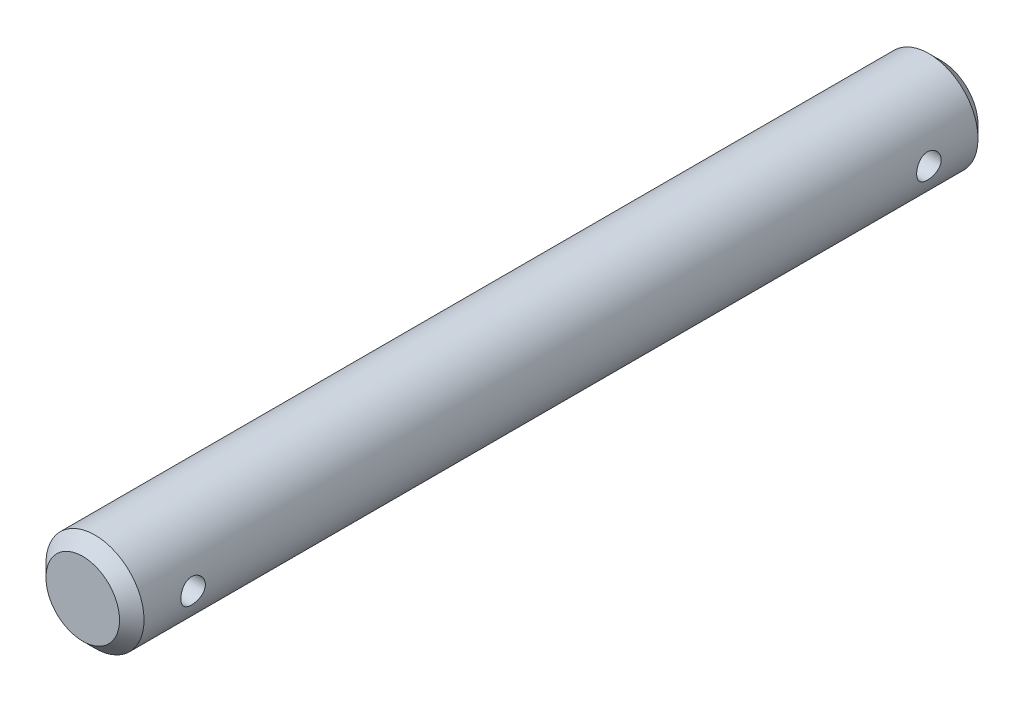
ISO-10303-21;
HEADER;
FILE_DESCRIPTION(('STEP AP214'),'2;1');
FILE_NAME('part.step','',(''),(''),'','','');
FILE_SCHEMA(('AUTOMOTIVE_DESIGN { 1 0 10303 214 1 1 1 1 }'));
ENDSEC;
DATA;
#1=APPLICATION_CONTEXT('core data for automotive mechanical design processes');
#2=APPLICATION_PROTOCOL_DEFINITION('international standard','automotive_design',2000,#1);
#3=PRODUCT_CONTEXT('',#1,'mechanical');
#4=PRODUCT('Part','Part','',(#3));
#5=PRODUCT_RELATED_PRODUCT_CATEGORY('part','',(#4));
#6=PRODUCT_DEFINITION_FORMATION('','',#4);
#7=PRODUCT_DEFINITION_CONTEXT('part definition',#1,'design');
#8=PRODUCT_DEFINITION('design','',#6,#7);
#9=PRODUCT_DEFINITION_SHAPE('','',#8);
#10=(LENGTH_UNIT() NAMED_UNIT(*) SI_UNIT(.MILLI.,.METRE.));
#11=(NAMED_UNIT(*) PLANE_ANGLE_UNIT() SI_UNIT($,.RADIAN.));
#12=(NAMED_UNIT(*) SI_UNIT($,.STERADIAN.) SOLID_ANGLE_UNIT());
#13=UNCERTAINTY_MEASURE_WITH_UNIT(LENGTH_MEASURE(1.E-05),#10,'distance_accuracy_value','');
#14=(GEOMETRIC_REPRESENTATION_CONTEXT(3) GLOBAL_UNCERTAINTY_ASSIGNED_CONTEXT((#13)) GLOBAL_UNIT_ASSIGNED_CONTEXT((#10,
#11,#12)) REPRESENTATION_CONTEXT('',''));
#15=CARTESIAN_POINT('',(0.,0.,0.));
#16=DIRECTION('',(0.,0.,1.));
#17=DIRECTION('',(1.,0.,0.));
#18=AXIS2_PLACEMENT_3D('',#15,#16,#17);
#19=CARTESIAN_POINT('',(0.,0.,70.));
#20=DIRECTION('',(0.,0.,-1.));
#21=DIRECTION('',(-1.,0.,0.));
#22=AXIS2_PLACEMENT_3D('',#19,#20,#21);
#23=CYLINDRICAL_SURFACE('',#22,4.);
#24=CARTESIAN_POINT('',(-4.,0.,6.));
#25=CARTESIAN_POINT('',(-3.99999906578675,-0.0552507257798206,5.9999984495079));
#26=CARTESIAN_POINT('',(-3.99884385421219,-0.110518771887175,5.99540563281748));
#27=CARTESIAN_POINT('',(-3.99434742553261,-0.219470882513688,5.977183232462));
#28=CARTESIAN_POINT('',(-3.99100496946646,-0.273154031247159,5.96354852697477));
#29=CARTESIAN_POINT('',(-3.98250417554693,-0.377347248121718,5.92770716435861));
#30=CARTESIAN_POINT('',(-3.97734801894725,-0.427861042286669,5.90551080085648));
#31=CARTESIAN_POINT('',(-3.96576895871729,-0.524448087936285,5.85321240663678));
#32=CARTESIAN_POINT('',(-3.95934601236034,-0.57052118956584,5.82311010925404));
#33=CARTESIAN_POINT('',(-3.94578275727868,-0.657867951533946,5.75519947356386));
#34=CARTESIAN_POINT('',(-3.93863138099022,-0.699037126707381,5.71725895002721));
#35=CARTESIAN_POINT('',(-3.92449080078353,-0.774499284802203,5.63503186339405));
#36=CARTESIAN_POINT('',(-3.91750161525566,-0.808791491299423,5.59074458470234));
#37=CARTESIAN_POINT('',(-3.9043651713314,-0.870017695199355,5.49626984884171));
#38=CARTESIAN_POINT('',(-3.89823196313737,-0.896834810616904,5.44600451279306));
#39=CARTESIAN_POINT('',(-3.88766329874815,-0.941597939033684,5.34150105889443));
#40=CARTESIAN_POINT('',(-3.88322757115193,-0.959545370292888,5.28726357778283));
#41=CARTESIAN_POINT('',(-3.87666984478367,-0.985703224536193,5.17750433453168));
#42=CARTESIAN_POINT('',(-3.87450327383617,-0.994101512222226,5.12203006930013));
#43=CARTESIAN_POINT('',(-3.87259575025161,-1.00150785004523,5.01042095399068));
#44=CARTESIAN_POINT('',(-3.87285440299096,-1.00051742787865,4.95428621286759));
#45=CARTESIAN_POINT('',(-3.87572803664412,-0.98932434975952,4.84438946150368));
#46=CARTESIAN_POINT('',(-3.87828575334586,-0.979345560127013,4.79060291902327));
#47=CARTESIAN_POINT('',(-3.88537806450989,-0.950816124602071,4.6854926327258));
#48=CARTESIAN_POINT('',(-3.88991279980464,-0.932264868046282,4.63416906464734));
#49=CARTESIAN_POINT('',(-3.90050075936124,-0.886926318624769,4.53484132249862));
#50=CARTESIAN_POINT('',(-3.90656884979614,-0.860057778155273,4.48687588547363));
#51=CARTESIAN_POINT('',(-3.91953140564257,-0.798904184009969,4.39605419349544));
#52=CARTESIAN_POINT('',(-3.9264260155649,-0.764617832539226,4.35319883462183));
#53=CARTESIAN_POINT('',(-3.94050587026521,-0.688442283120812,4.2725309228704));
#54=CARTESIAN_POINT('',(-3.94769379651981,-0.646364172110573,4.23489700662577));
#55=CARTESIAN_POINT('',(-3.96137310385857,-0.556407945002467,4.1671858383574));
#56=CARTESIAN_POINT('',(-3.96786446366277,-0.508529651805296,4.13710881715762));
#57=CARTESIAN_POINT('',(-3.97945154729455,-0.408077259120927,4.08529960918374));
#58=CARTESIAN_POINT('',(-3.9845424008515,-0.355487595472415,4.06359643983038));
#59=CARTESIAN_POINT('',(-3.99271944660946,-0.247250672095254,4.02938846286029));
#60=CARTESIAN_POINT('',(-3.99580602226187,-0.191603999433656,4.01688189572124));
#61=CARTESIAN_POINT('',(-3.9995699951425,-0.0803599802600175,4.00169495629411));
#62=CARTESIAN_POINT('',(-4.00030702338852,-0.0247978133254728,3.9987713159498));
#63=CARTESIAN_POINT('',(-3.999458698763,0.086021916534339,4.00216600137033));
#64=CARTESIAN_POINT('',(-3.99787355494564,0.14127950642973,4.00848349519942));
#65=CARTESIAN_POINT('',(-3.99259720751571,0.249076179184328,4.02998060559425));
#66=CARTESIAN_POINT('',(-3.98893756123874,0.301643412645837,4.04502750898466));
#67=CARTESIAN_POINT('',(-3.97992471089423,0.403504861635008,4.08340472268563));
#68=CARTESIAN_POINT('',(-3.97457133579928,0.452798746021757,4.10673586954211));
#69=CARTESIAN_POINT('',(-3.96262205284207,0.547682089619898,4.16149075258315));
#70=CARTESIAN_POINT('',(-3.95600578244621,0.59319029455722,4.19305074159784));
#71=CARTESIAN_POINT('',(-3.94229672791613,0.678351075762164,4.26319327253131));
#72=CARTESIAN_POINT('',(-3.93520386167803,0.718002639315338,4.30177702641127));
#73=CARTESIAN_POINT('',(-3.92112637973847,0.79132704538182,4.38600130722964));
#74=CARTESIAN_POINT('',(-3.91414869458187,0.824829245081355,4.43179180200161));
#75=CARTESIAN_POINT('',(-3.90128585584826,0.883673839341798,4.52848842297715));
#76=CARTESIAN_POINT('',(-3.89540065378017,0.909016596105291,4.57939432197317));
#77=CARTESIAN_POINT('',(-3.88545396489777,0.950634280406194,4.68460381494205));
#78=CARTESIAN_POINT('',(-3.88138170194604,0.96696293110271,4.73888508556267));
#79=CARTESIAN_POINT('',(-3.87551162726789,0.990230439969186,4.84953975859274));
#80=CARTESIAN_POINT('',(-3.87371331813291,0.997171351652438,4.90591270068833));
#81=CARTESIAN_POINT('',(-3.87263267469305,1.00135906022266,5.01741401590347));
#82=CARTESIAN_POINT('',(-3.87327955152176,0.998878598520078,5.07253162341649));
#83=CARTESIAN_POINT('',(-3.87685272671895,0.984918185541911,5.18153592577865));
#84=CARTESIAN_POINT('',(-3.87977897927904,0.973438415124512,5.23542264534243));
#85=CARTESIAN_POINT('',(-3.88754173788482,0.941954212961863,5.34013897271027));
#86=CARTESIAN_POINT('',(-3.89236676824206,0.922000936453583,5.39098487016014));
#87=CARTESIAN_POINT('',(-3.90338503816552,0.874176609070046,5.48864358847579));
#88=CARTESIAN_POINT('',(-3.90957846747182,0.846304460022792,5.53545584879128));
#89=CARTESIAN_POINT('',(-3.92283756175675,0.782578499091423,5.62503641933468));
#90=CARTESIAN_POINT('',(-3.92992176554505,0.746535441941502,5.66766738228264));
#91=CARTESIAN_POINT('',(-3.94405351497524,0.667859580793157,5.74636469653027));
#92=CARTESIAN_POINT('',(-3.95110105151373,0.625225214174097,5.78242948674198));
#93=CARTESIAN_POINT('',(-3.96451770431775,0.533645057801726,5.84760753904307));
#94=CARTESIAN_POINT('',(-3.97087222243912,0.484598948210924,5.87658307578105));
#95=CARTESIAN_POINT('',(-3.98203283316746,0.382177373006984,5.92583164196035));
#96=CARTESIAN_POINT('',(-3.98684003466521,0.328805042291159,5.94611090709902));
#97=CARTESIAN_POINT('',(-3.99365373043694,0.229606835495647,5.97438122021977));
#98=CARTESIAN_POINT('',(-3.9960172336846,0.184253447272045,5.98396749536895));
#99=CARTESIAN_POINT('',(-3.99919070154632,0.0926040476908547,5.99677729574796));
#100=CARTESIAN_POINT('',(-4.00000078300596,0.0463081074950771,6.00000129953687));
#101=CARTESIAN_POINT('',(-4.,0.,6.));
#102=B_SPLINE_CURVE_WITH_KNOTS('',3,(#24,#25,#26,#27,#28,#29,#30,#31,#32,#33,#34,#35,#36,#37,
#38,#39,#40,#41,#42,#43,#44,#45,#46,#47,#48,#49,#50,#51,#52,#53,#54,#55,#56,#57,#58,#59,#60,#61,
#62,#63,#64,#65,#66,#67,#68,#69,#70,#71,#72,#73,#74,#75,#76,#77,#78,#79,#80,#81,#82,#83,#84,#85,
#86,#87,#88,#89,#90,#91,#92,#93,#94,#95,#96,#97,#98,#99,#100,#101),.UNSPECIFIED.,.T.,.F.,(4,2,2,
2,2,2,2,2,2,2,2,2,2,2,2,2,2,2,2,2,2,2,2,2,2,2,2,2,2,2,2,2,2,2,2,2,2,2,4),(0.,0.16558247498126,
0.331258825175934,0.496736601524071,0.662219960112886,0.830762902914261,0.99932486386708,
1.17039098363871,1.34142974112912,1.50904196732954,1.67662692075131,1.84014998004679,
2.00368468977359,2.16887018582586,2.33408460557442,2.50401000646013,2.67394059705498,
2.84445486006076,3.01493649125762,3.18105539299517,3.34715934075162,3.51080183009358,
3.67446084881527,3.84102391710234,4.00761575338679,4.17829672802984,4.34897012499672,
4.51861503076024,4.68822282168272,4.85295853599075,5.01769093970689,5.18144267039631,
5.34521712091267,5.51326384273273,5.68135046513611,5.85248123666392,6.02348909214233,
6.16228161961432,6.30106370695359),.UNSPECIFIED.);
#103=CARTESIAN_POINT('',(-4.,0.,6.));
#104=VERTEX_POINT('',#103);
#105=EDGE_CURVE('E10',#104,#104,#102,.T.);
#106=ORIENTED_EDGE('',*,*,#105,.T.);
#107=EDGE_LOOP('',(#106));
#108=FACE_BOUND('',#107,.T.);
#109=CARTESIAN_POINT('',(4.,0.,4.));
#110=CARTESIAN_POINT('',(3.99999906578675,-0.0552507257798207,4.00000155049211));
#111=CARTESIAN_POINT('',(3.99884385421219,-0.110518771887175,4.00459436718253));
#112=CARTESIAN_POINT('',(3.99434742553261,-0.219470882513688,4.022816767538));
#113=CARTESIAN_POINT('',(3.99100496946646,-0.273154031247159,4.03645147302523));
#114=CARTESIAN_POINT('',(3.98250417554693,-0.377347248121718,4.07229283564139));
#115=CARTESIAN_POINT('',(3.97734801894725,-0.427861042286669,4.09448919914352));
#116=CARTESIAN_POINT('',(3.96576895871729,-0.524448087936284,4.14678759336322));
#117=CARTESIAN_POINT('',(3.95934601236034,-0.570521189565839,4.17688989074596));
#118=CARTESIAN_POINT('',(3.94578275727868,-0.657867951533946,4.24480052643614));
#119=CARTESIAN_POINT('',(3.93863138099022,-0.699037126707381,4.28274104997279));
#120=CARTESIAN_POINT('',(3.92449080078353,-0.774499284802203,4.36496813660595));
#121=CARTESIAN_POINT('',(3.91750161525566,-0.808791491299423,4.40925541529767));
#122=CARTESIAN_POINT('',(3.9043651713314,-0.870017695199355,4.50373015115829));
#123=CARTESIAN_POINT('',(3.89823196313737,-0.896834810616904,4.55399548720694));
#124=CARTESIAN_POINT('',(3.88766329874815,-0.941597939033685,4.65849894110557));
#125=CARTESIAN_POINT('',(3.88322757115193,-0.959545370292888,4.71273642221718));
#126=CARTESIAN_POINT('',(3.87666984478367,-0.985703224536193,4.82249566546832));
#127=CARTESIAN_POINT('',(3.87450327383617,-0.994101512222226,4.87796993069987));
#128=CARTESIAN_POINT('',(3.87259575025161,-1.00150785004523,4.98957904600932));
#129=CARTESIAN_POINT('',(3.87285440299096,-1.00051742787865,5.04571378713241));
#130=CARTESIAN_POINT('',(3.87572803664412,-0.98932434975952,5.15561053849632));
#131=CARTESIAN_POINT('',(3.87828575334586,-0.979345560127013,5.20939708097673));
#132=CARTESIAN_POINT('',(3.88537806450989,-0.950816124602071,5.3145073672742));
#133=CARTESIAN_POINT('',(3.88991279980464,-0.932264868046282,5.36583093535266));
#134=CARTESIAN_POINT('',(3.90050075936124,-0.886926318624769,5.46515867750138));
#135=CARTESIAN_POINT('',(3.90656884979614,-0.860057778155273,5.51312411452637));
#136=CARTESIAN_POINT('',(3.91953140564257,-0.798904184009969,5.60394580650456));
#137=CARTESIAN_POINT('',(3.9264260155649,-0.764617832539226,5.64680116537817));
#138=CARTESIAN_POINT('',(3.94050587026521,-0.688442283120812,5.7274690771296));
#139=CARTESIAN_POINT('',(3.94769379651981,-0.646364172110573,5.76510299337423));
#140=CARTESIAN_POINT('',(3.96137310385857,-0.556407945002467,5.8328141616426));
#141=CARTESIAN_POINT('',(3.96786446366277,-0.508529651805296,5.86289118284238));
#142=CARTESIAN_POINT('',(3.97945154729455,-0.408077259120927,5.91470039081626));
#143=CARTESIAN_POINT('',(3.9845424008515,-0.355487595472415,5.93640356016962));
#144=CARTESIAN_POINT('',(3.99271944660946,-0.247250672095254,5.97061153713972));
#145=CARTESIAN_POINT('',(3.99580602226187,-0.191603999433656,5.98311810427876));
#146=CARTESIAN_POINT('',(3.9995699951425,-0.0803599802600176,5.99830504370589));
#147=CARTESIAN_POINT('',(4.00030702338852,-0.0247978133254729,6.0012286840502));
#148=CARTESIAN_POINT('',(3.999458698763,0.0860219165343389,5.99783399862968));
#149=CARTESIAN_POINT('',(3.99787355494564,0.14127950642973,5.99151650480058));
#150=CARTESIAN_POINT('',(3.99259720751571,0.249076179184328,5.97001939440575));
#151=CARTESIAN_POINT('',(3.98893756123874,0.301643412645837,5.95497249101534));
#152=CARTESIAN_POINT('',(3.97992471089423,0.403504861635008,5.91659527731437));
#153=CARTESIAN_POINT('',(3.97457133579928,0.452798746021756,5.89326413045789));
#154=CARTESIAN_POINT('',(3.96262205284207,0.547682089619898,5.83850924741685));
#155=CARTESIAN_POINT('',(3.95600578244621,0.59319029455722,5.80694925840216));
#156=CARTESIAN_POINT('',(3.94229672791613,0.678351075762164,5.73680672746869));
#157=CARTESIAN_POINT('',(3.93520386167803,0.718002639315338,5.69822297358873));
#158=CARTESIAN_POINT('',(3.92112637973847,0.79132704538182,5.61399869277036));
#159=CARTESIAN_POINT('',(3.91414869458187,0.824829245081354,5.56820819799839));
#160=CARTESIAN_POINT('',(3.90128585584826,0.883673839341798,5.47151157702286));
#161=CARTESIAN_POINT('',(3.89540065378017,0.909016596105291,5.42060567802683));
#162=CARTESIAN_POINT('',(3.88545396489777,0.950634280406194,5.31539618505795));
#163=CARTESIAN_POINT('',(3.88138170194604,0.96696293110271,5.26111491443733));
#164=CARTESIAN_POINT('',(3.87551162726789,0.990230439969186,5.15046024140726));
#165=CARTESIAN_POINT('',(3.87371331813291,0.997171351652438,5.09408729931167));
#166=CARTESIAN_POINT('',(3.87263267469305,1.00135906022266,4.98258598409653));
#167=CARTESIAN_POINT('',(3.87327955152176,0.998878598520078,4.92746837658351));
#168=CARTESIAN_POINT('',(3.87685272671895,0.984918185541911,4.81846407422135));
#169=CARTESIAN_POINT('',(3.87977897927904,0.973438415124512,4.76457735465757));
#170=CARTESIAN_POINT('',(3.88754173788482,0.941954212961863,4.65986102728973));
#171=CARTESIAN_POINT('',(3.89236676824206,0.922000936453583,4.60901512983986));
#172=CARTESIAN_POINT('',(3.90338503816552,0.874176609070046,4.51135641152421));
#173=CARTESIAN_POINT('',(3.90957846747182,0.846304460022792,4.46454415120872));
#174=CARTESIAN_POINT('',(3.92283756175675,0.782578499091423,4.37496358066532));
#175=CARTESIAN_POINT('',(3.92992176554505,0.746535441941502,4.33233261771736));
#176=CARTESIAN_POINT('',(3.94405351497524,0.667859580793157,4.25363530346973));
#177=CARTESIAN_POINT('',(3.95110105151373,0.625225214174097,4.21757051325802));
#178=CARTESIAN_POINT('',(3.96451770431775,0.533645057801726,4.15239246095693));
#179=CARTESIAN_POINT('',(3.97087222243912,0.484598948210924,4.12341692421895));
#180=CARTESIAN_POINT('',(3.98203283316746,0.382177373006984,4.07416835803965));
#181=CARTESIAN_POINT('',(3.98684003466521,0.328805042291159,4.05388909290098));
#182=CARTESIAN_POINT('',(3.99365373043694,0.229606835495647,4.02561877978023));
#183=CARTESIAN_POINT('',(3.9960172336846,0.184253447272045,4.01603250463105));
#184=CARTESIAN_POINT('',(3.99919070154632,0.0926040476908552,4.00322270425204));
#185=CARTESIAN_POINT('',(4.00000078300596,0.0463081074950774,3.99999870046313));
#186=CARTESIAN_POINT('',(4.,0.,4.));
#187=B_SPLINE_CURVE_WITH_KNOTS('',3,(#109,#110,#111,#112,#113,#114,#115,#116,#117,#118,#119,
#120,#121,#122,#123,#124,#125,#126,#127,#128,#129,#130,#131,#132,#133,#134,#135,#136,#137,#138,
#139,#140,#141,#142,#143,#144,#145,#146,#147,#148,#149,#150,#151,#152,#153,#154,#155,#156,#157,
#158,#159,#160,#161,#162,#163,#164,#165,#166,#167,#168,#169,#170,#171,#172,#173,#174,#175,#176,
#177,#178,#179,#180,#181,#182,#183,#184,#185,#186),.UNSPECIFIED.,.T.,.F.,(4,2,2,2,2,2,2,2,2,2,2,
2,2,2,2,2,2,2,2,2,2,2,2,2,2,2,2,2,2,2,2,2,2,2,2,2,2,2,4),(0.,0.16558247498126,0.331258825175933,
0.49673660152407,0.662219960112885,0.83076290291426,0.999324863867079,1.17039098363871,
1.34142974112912,1.50904196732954,1.67662692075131,1.84014998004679,2.00368468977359,
2.16887018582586,2.33408460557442,2.50401000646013,2.67394059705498,2.84445486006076,
3.01493649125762,3.18105539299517,3.34715934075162,3.51080183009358,3.67446084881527,
3.84102391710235,4.00761575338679,4.17829672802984,4.34897012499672,4.51861503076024,
4.68822282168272,4.85295853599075,5.01769093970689,5.18144267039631,5.34521712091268,
5.51326384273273,5.68135046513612,5.85248123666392,6.02348909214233,6.16228161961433,
6.3010637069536),.UNSPECIFIED.);
#188=CARTESIAN_POINT('',(4.,0.,4.));
#189=VERTEX_POINT('',#188);
#190=EDGE_CURVE('E32',#189,#189,#187,.T.);
#191=ORIENTED_EDGE('',*,*,#190,.T.);
#192=EDGE_LOOP('',(#191));
#193=FACE_BOUND('',#192,.T.);
#194=CARTESIAN_POINT('',(-4.,0.,66.));
#195=CARTESIAN_POINT('',(-3.99999906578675,-0.0552507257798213,65.9999984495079));
#196=CARTESIAN_POINT('',(-3.99884385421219,-0.110518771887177,65.9954056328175));
#197=CARTESIAN_POINT('',(-3.99434742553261,-0.21947088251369,65.977183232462));
#198=CARTESIAN_POINT('',(-3.99100496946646,-0.273154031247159,65.9635485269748));
#199=CARTESIAN_POINT('',(-3.98250417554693,-0.377347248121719,65.9277071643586));
#200=CARTESIAN_POINT('',(-3.97734801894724,-0.427861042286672,65.9055108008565));
#201=CARTESIAN_POINT('',(-3.96576895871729,-0.524448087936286,65.8532124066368));
#202=CARTESIAN_POINT('',(-3.95934601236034,-0.570521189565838,65.823110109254));
#203=CARTESIAN_POINT('',(-3.94578275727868,-0.657867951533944,65.7551994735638));
#204=CARTESIAN_POINT('',(-3.93863138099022,-0.699037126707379,65.7172589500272));
#205=CARTESIAN_POINT('',(-3.92449080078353,-0.774499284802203,65.6350318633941));
#206=CARTESIAN_POINT('',(-3.91750161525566,-0.808791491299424,65.5907445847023));
#207=CARTESIAN_POINT('',(-3.9043651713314,-0.870017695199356,65.4962698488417));
#208=CARTESIAN_POINT('',(-3.89823196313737,-0.896834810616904,65.4460045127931));
#209=CARTESIAN_POINT('',(-3.88766329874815,-0.941597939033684,65.3415010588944));
#210=CARTESIAN_POINT('',(-3.88322757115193,-0.959545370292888,65.2872635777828));
#211=CARTESIAN_POINT('',(-3.87666984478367,-0.985703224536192,65.1775043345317));
#212=CARTESIAN_POINT('',(-3.87450327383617,-0.994101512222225,65.1220300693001));
#213=CARTESIAN_POINT('',(-3.87259575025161,-1.00150785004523,65.0104209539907));
#214=CARTESIAN_POINT('',(-3.87285440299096,-1.00051742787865,64.9542862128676));
#215=CARTESIAN_POINT('',(-3.87572803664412,-0.989324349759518,64.8443894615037));
#216=CARTESIAN_POINT('',(-3.87828575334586,-0.979345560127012,64.7906029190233));
#217=CARTESIAN_POINT('',(-3.88537806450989,-0.950816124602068,64.6854926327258));
#218=CARTESIAN_POINT('',(-3.88991279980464,-0.932264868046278,64.6341690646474));
#219=CARTESIAN_POINT('',(-3.90050075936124,-0.886926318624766,64.5348413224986));
#220=CARTESIAN_POINT('',(-3.90656884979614,-0.860057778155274,64.4868758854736));
#221=CARTESIAN_POINT('',(-3.91953140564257,-0.798904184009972,64.3960541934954));
#222=CARTESIAN_POINT('',(-3.9264260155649,-0.764617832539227,64.3531988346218));
#223=CARTESIAN_POINT('',(-3.94050587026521,-0.688442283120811,64.2725309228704));
#224=CARTESIAN_POINT('',(-3.94769379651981,-0.646364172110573,64.2348970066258));
#225=CARTESIAN_POINT('',(-3.96137310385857,-0.556407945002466,64.1671858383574));
#226=CARTESIAN_POINT('',(-3.96786446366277,-0.508529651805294,64.1371088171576));
#227=CARTESIAN_POINT('',(-3.97945154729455,-0.408077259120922,64.0852996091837));
#228=CARTESIAN_POINT('',(-3.9845424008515,-0.355487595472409,64.0635964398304));
#229=CARTESIAN_POINT('',(-3.99271944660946,-0.247250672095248,64.0293884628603));
#230=CARTESIAN_POINT('',(-3.99580602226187,-0.19160399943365,64.0168818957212));
#231=CARTESIAN_POINT('',(-3.9995699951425,-0.0803599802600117,64.0016949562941));
#232=CARTESIAN_POINT('',(-4.00030702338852,-0.0247978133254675,63.9987713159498));
#233=CARTESIAN_POINT('',(-3.999458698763,0.0860219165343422,64.0021660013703));
#234=CARTESIAN_POINT('',(-3.99787355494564,0.141279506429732,64.0084834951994));
#235=CARTESIAN_POINT('',(-3.99259720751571,0.249076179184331,64.0299806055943));
#236=CARTESIAN_POINT('',(-3.98893756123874,0.301643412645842,64.0450275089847));
#237=CARTESIAN_POINT('',(-3.97992471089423,0.403504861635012,64.0834047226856));
#238=CARTESIAN_POINT('',(-3.97457133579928,0.452798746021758,64.1067358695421));
#239=CARTESIAN_POINT('',(-3.96262205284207,0.5476820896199,64.1614907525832));
#240=CARTESIAN_POINT('',(-3.95600578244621,0.593190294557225,64.1930507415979));
#241=CARTESIAN_POINT('',(-3.94229672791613,0.67835107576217,64.2631932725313));
#242=CARTESIAN_POINT('',(-3.93520386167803,0.718002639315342,64.3017770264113));
#243=CARTESIAN_POINT('',(-3.92112637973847,0.791327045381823,64.3860013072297));
#244=CARTESIAN_POINT('',(-3.91414869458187,0.824829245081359,64.4317918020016));
#245=CARTESIAN_POINT('',(-3.90128585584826,0.883673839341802,64.5284884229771));
#246=CARTESIAN_POINT('',(-3.89540065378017,0.909016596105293,64.5793943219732));
#247=CARTESIAN_POINT('',(-3.88545396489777,0.950634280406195,64.6846038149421));
#248=CARTESIAN_POINT('',(-3.88138170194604,0.96696293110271,64.7388850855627));
#249=CARTESIAN_POINT('',(-3.87551162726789,0.990230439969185,64.8495397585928));
#250=CARTESIAN_POINT('',(-3.87371331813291,0.997171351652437,64.9059127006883));
#251=CARTESIAN_POINT('',(-3.87263267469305,1.00135906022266,65.0174140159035));
#252=CARTESIAN_POINT('',(-3.87327955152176,0.998878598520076,65.0725316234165));
#253=CARTESIAN_POINT('',(-3.87685272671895,0.984918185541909,65.1815359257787));
#254=CARTESIAN_POINT('',(-3.87977897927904,0.973438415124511,65.2354226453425));
#255=CARTESIAN_POINT('',(-3.88754173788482,0.941954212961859,65.3401389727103));
#256=CARTESIAN_POINT('',(-3.89236676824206,0.922000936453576,65.3909848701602));
#257=CARTESIAN_POINT('',(-3.90338503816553,0.874176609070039,65.4886435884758));
#258=CARTESIAN_POINT('',(-3.90957846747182,0.846304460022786,65.5354558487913));
#259=CARTESIAN_POINT('',(-3.92283756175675,0.782578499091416,65.6250364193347));
#260=CARTESIAN_POINT('',(-3.92992176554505,0.74653544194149,65.6676673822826));
#261=CARTESIAN_POINT('',(-3.94405351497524,0.667859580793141,65.7463646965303));
#262=CARTESIAN_POINT('',(-3.95110105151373,0.625225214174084,65.782429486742));
#263=CARTESIAN_POINT('',(-3.96451770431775,0.533645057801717,65.8476075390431));
#264=CARTESIAN_POINT('',(-3.97087222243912,0.484598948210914,65.8765830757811));
#265=CARTESIAN_POINT('',(-3.98203283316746,0.382177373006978,65.9258316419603));
#266=CARTESIAN_POINT('',(-3.98684003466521,0.328805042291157,65.946110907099));
#267=CARTESIAN_POINT('',(-3.99365373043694,0.229606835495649,65.9743812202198));
#268=CARTESIAN_POINT('',(-3.9960172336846,0.184253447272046,65.9839674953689));
#269=CARTESIAN_POINT('',(-3.99919070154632,0.0926040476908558,65.996777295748));
#270=CARTESIAN_POINT('',(-4.00000078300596,0.0463081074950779,66.0000012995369));
#271=CARTESIAN_POINT('',(-4.,0.,66.));
#272=B_SPLINE_CURVE_WITH_KNOTS('',3,(#194,#195,#196,#197,#198,#199,#200,#201,#202,#203,#204,
#205,#206,#207,#208,#209,#210,#211,#212,#213,#214,#215,#216,#217,#218,#219,#220,#221,#222,#223,
#224,#225,#226,#227,#228,#229,#230,#231,#232,#233,#234,#235,#236,#237,#238,#239,#240,#241,#242,
#243,#244,#245,#246,#247,#248,#249,#250,#251,#252,#253,#254,#255,#256,#257,#258,#259,#260,#261,
#262,#263,#264,#265,#266,#267,#268,#269,#270,#271),.UNSPECIFIED.,.T.,.F.,(4,2,2,2,2,2,2,2,2,2,2,
2,2,2,2,2,2,2,2,2,2,2,2,2,2,2,2,2,2,2,2,2,2,2,2,2,2,2,4),(0.,0.165582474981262,
0.331258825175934,0.496736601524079,0.662219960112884,0.830762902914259,0.999324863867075,
1.17039098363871,1.34142974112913,1.50904196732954,1.67662692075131,1.84014998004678,
2.00368468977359,2.16887018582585,2.33408460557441,2.50401000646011,2.67394059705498,
2.84445486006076,3.01493649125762,3.18105539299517,3.34715934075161,3.51080183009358,
3.67446084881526,3.84102391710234,4.00761575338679,4.17829672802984,4.34897012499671,
4.51861503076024,4.68822282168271,4.85295853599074,5.01769093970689,5.18144267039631,
5.34521712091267,5.51326384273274,5.68135046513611,5.85248123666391,6.02348909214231,
6.16228161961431,6.30106370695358),.UNSPECIFIED.);
#273=CARTESIAN_POINT('',(-4.,0.,66.));
#274=VERTEX_POINT('',#273);
#275=EDGE_CURVE('E36',#274,#274,#272,.T.);
#276=ORIENTED_EDGE('',*,*,#275,.T.);
#277=EDGE_LOOP('',(#276));
#278=FACE_BOUND('',#277,.T.);
#279=CARTESIAN_POINT('',(4.,0.,64.));
#280=CARTESIAN_POINT('',(3.99999906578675,-0.0552507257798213,64.0000015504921));
#281=CARTESIAN_POINT('',(3.99884385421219,-0.110518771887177,64.0045943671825));
#282=CARTESIAN_POINT('',(3.99434742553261,-0.219470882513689,64.022816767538));
#283=CARTESIAN_POINT('',(3.99100496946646,-0.273154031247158,64.0364514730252));
#284=CARTESIAN_POINT('',(3.98250417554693,-0.377347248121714,64.0722928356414));
#285=CARTESIAN_POINT('',(3.97734801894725,-0.427861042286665,64.0944891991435));
#286=CARTESIAN_POINT('',(3.96576895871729,-0.52444808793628,64.1467875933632));
#287=CARTESIAN_POINT('',(3.95934601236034,-0.570521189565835,64.176889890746));
#288=CARTESIAN_POINT('',(3.94578275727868,-0.657867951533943,64.2448005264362));
#289=CARTESIAN_POINT('',(3.93863138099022,-0.699037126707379,64.2827410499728));
#290=CARTESIAN_POINT('',(3.92449080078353,-0.774499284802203,64.3649681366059));
#291=CARTESIAN_POINT('',(3.91750161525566,-0.808791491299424,64.4092554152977));
#292=CARTESIAN_POINT('',(3.9043651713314,-0.870017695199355,64.5037301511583));
#293=CARTESIAN_POINT('',(3.89823196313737,-0.896834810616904,64.5539954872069));
#294=CARTESIAN_POINT('',(3.88766329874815,-0.941597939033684,64.6584989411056));
#295=CARTESIAN_POINT('',(3.88322757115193,-0.959545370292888,64.7127364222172));
#296=CARTESIAN_POINT('',(3.87666984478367,-0.985703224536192,64.8224956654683));
#297=CARTESIAN_POINT('',(3.87450327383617,-0.994101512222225,64.8779699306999));
#298=CARTESIAN_POINT('',(3.87259575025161,-1.00150785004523,64.9895790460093));
#299=CARTESIAN_POINT('',(3.87285440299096,-1.00051742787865,65.0457137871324));
#300=CARTESIAN_POINT('',(3.87572803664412,-0.989324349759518,65.1556105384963));
#301=CARTESIAN_POINT('',(3.87828575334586,-0.979345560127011,65.2093970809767));
#302=CARTESIAN_POINT('',(3.88537806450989,-0.950816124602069,65.3145073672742));
#303=CARTESIAN_POINT('',(3.88991279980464,-0.932264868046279,65.3658309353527));
#304=CARTESIAN_POINT('',(3.90050075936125,-0.886926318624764,65.4651586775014));
#305=CARTESIAN_POINT('',(3.90656884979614,-0.860057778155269,65.5131241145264));
#306=CARTESIAN_POINT('',(3.91953140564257,-0.798904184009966,65.6039458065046));
#307=CARTESIAN_POINT('',(3.9264260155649,-0.764617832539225,65.6468011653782));
#308=CARTESIAN_POINT('',(3.94050587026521,-0.688442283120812,65.7274690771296));
#309=CARTESIAN_POINT('',(3.94769379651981,-0.646364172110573,65.7651029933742));
#310=CARTESIAN_POINT('',(3.96137310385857,-0.556407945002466,65.8328141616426));
#311=CARTESIAN_POINT('',(3.96786446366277,-0.508529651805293,65.8628911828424));
#312=CARTESIAN_POINT('',(3.97945154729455,-0.408077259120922,65.9147003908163));
#313=CARTESIAN_POINT('',(3.9845424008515,-0.355487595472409,65.9364035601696));
#314=CARTESIAN_POINT('',(3.99271944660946,-0.247250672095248,65.9706115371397));
#315=CARTESIAN_POINT('',(3.99580602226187,-0.191603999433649,65.9831181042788));
#316=CARTESIAN_POINT('',(3.9995699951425,-0.0803599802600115,65.9983050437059));
#317=CARTESIAN_POINT('',(4.00030702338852,-0.0247978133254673,66.0012286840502));
#318=CARTESIAN_POINT('',(3.999458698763,0.0860219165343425,65.9978339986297));
#319=CARTESIAN_POINT('',(3.99787355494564,0.141279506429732,65.9915165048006));
#320=CARTESIAN_POINT('',(3.99259720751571,0.249076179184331,65.9700193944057));
#321=CARTESIAN_POINT('',(3.98893756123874,0.301643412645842,65.9549724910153));
#322=CARTESIAN_POINT('',(3.97992471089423,0.403504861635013,65.9165952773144));
#323=CARTESIAN_POINT('',(3.97457133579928,0.452798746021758,65.8932641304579));
#324=CARTESIAN_POINT('',(3.96262205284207,0.5476820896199,65.8385092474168));
#325=CARTESIAN_POINT('',(3.95600578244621,0.593190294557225,65.8069492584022));
#326=CARTESIAN_POINT('',(3.94229672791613,0.67835107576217,65.7368067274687));
#327=CARTESIAN_POINT('',(3.93520386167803,0.718002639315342,65.6982229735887));
#328=CARTESIAN_POINT('',(3.92112637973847,0.791327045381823,65.6139986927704));
#329=CARTESIAN_POINT('',(3.91414869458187,0.824829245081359,65.5682081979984));
#330=CARTESIAN_POINT('',(3.90128585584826,0.883673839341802,65.4715115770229));
#331=CARTESIAN_POINT('',(3.89540065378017,0.909016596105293,65.4206056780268));
#332=CARTESIAN_POINT('',(3.88545396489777,0.950634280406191,65.3153961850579));
#333=CARTESIAN_POINT('',(3.88138170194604,0.966962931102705,65.2611149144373));
#334=CARTESIAN_POINT('',(3.87551162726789,0.990230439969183,65.1504602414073));
#335=CARTESIAN_POINT('',(3.87371331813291,0.997171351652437,65.0940872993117));
#336=CARTESIAN_POINT('',(3.87263267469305,1.00135906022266,64.9825859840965));
#337=CARTESIAN_POINT('',(3.87327955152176,0.998878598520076,64.9274683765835));
#338=CARTESIAN_POINT('',(3.87685272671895,0.984918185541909,64.8184640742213));
#339=CARTESIAN_POINT('',(3.87977897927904,0.973438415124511,64.7645773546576));
#340=CARTESIAN_POINT('',(3.88754173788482,0.941954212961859,64.6598610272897));
#341=CARTESIAN_POINT('',(3.89236676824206,0.922000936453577,64.6090151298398));
#342=CARTESIAN_POINT('',(3.90338503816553,0.874176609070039,64.5113564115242));
#343=CARTESIAN_POINT('',(3.90957846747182,0.846304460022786,64.4645441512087));
#344=CARTESIAN_POINT('',(3.92283756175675,0.782578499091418,64.3749635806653));
#345=CARTESIAN_POINT('',(3.92992176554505,0.746535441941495,64.3323326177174));
#346=CARTESIAN_POINT('',(3.94405351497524,0.667859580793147,64.2536353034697));
#347=CARTESIAN_POINT('',(3.95110105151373,0.625225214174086,64.217570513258));
#348=CARTESIAN_POINT('',(3.96451770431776,0.533645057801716,64.1523924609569));
#349=CARTESIAN_POINT('',(3.97087222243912,0.484598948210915,64.1234169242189));
#350=CARTESIAN_POINT('',(3.98203283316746,0.382177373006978,64.0741683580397));
#351=CARTESIAN_POINT('',(3.98684003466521,0.328805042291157,64.053889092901));
#352=CARTESIAN_POINT('',(3.99365373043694,0.229606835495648,64.0256187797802));
#353=CARTESIAN_POINT('',(3.9960172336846,0.184253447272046,64.0160325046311));
#354=CARTESIAN_POINT('',(3.99919070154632,0.0926040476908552,64.003222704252));
#355=CARTESIAN_POINT('',(4.00000078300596,0.0463081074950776,63.9999987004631));
#356=CARTESIAN_POINT('',(4.,0.,64.));
#357=B_SPLINE_CURVE_WITH_KNOTS('',3,(#279,#280,#281,#282,#283,#284,#285,#286,#287,#288,#289,
#290,#291,#292,#293,#294,#295,#296,#297,#298,#299,#300,#301,#302,#303,#304,#305,#306,#307,#308,
#309,#310,#311,#312,#313,#314,#315,#316,#317,#318,#319,#320,#321,#322,#323,#324,#325,#326,#327,
#328,#329,#330,#331,#332,#333,#334,#335,#336,#337,#338,#339,#340,#341,#342,#343,#344,#345,#346,
#347,#348,#349,#350,#351,#352,#353,#354,#355,#356),.UNSPECIFIED.,.T.,.F.,(4,2,2,2,2,2,2,2,2,2,2,
2,2,2,2,2,2,2,2,2,2,2,2,2,2,2,2,2,2,2,2,2,2,2,2,2,2,2,4),(0.,0.165582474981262,
0.331258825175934,0.496736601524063,0.662219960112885,0.83076290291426,0.999324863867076,
1.17039098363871,1.34142974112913,1.50904196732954,1.67662692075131,1.84014998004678,
2.00368468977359,2.16887018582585,2.33408460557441,2.50401000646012,2.67394059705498,
2.84445486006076,3.01493649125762,3.18105539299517,3.34715934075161,3.51080183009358,
3.67446084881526,3.84102391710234,4.00761575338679,4.17829672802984,4.34897012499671,
4.51861503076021,4.68822282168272,4.85295853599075,5.01769093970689,5.18144267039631,
5.34521712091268,5.51326384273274,5.68135046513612,5.85248123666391,6.02348909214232,
6.16228161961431,6.30106370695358),.UNSPECIFIED.);
#358=CARTESIAN_POINT('',(4.,0.,64.));
#359=VERTEX_POINT('',#358);
#360=EDGE_CURVE('E40',#359,#359,#357,.T.);
#361=ORIENTED_EDGE('',*,*,#360,.T.);
#362=EDGE_LOOP('',(#361));
#363=FACE_BOUND('',#362,.T.);
#364=CARTESIAN_POINT('',(0.,0.,69.));
#365=DIRECTION('',(0.,0.,1.));
#366=DIRECTION('',(1.,0.,0.));
#367=AXIS2_PLACEMENT_3D('',#364,#365,#366);
#368=CIRCLE('',#367,4.);
#369=CARTESIAN_POINT('',(4.,0.,69.));
#370=VERTEX_POINT('',#369);
#371=EDGE_CURVE('E68',#370,#370,#368,.F.);
#372=ORIENTED_EDGE('',*,*,#371,.T.);
#373=EDGE_LOOP('',(#372));
#374=FACE_BOUND('',#373,.T.);
#375=CARTESIAN_POINT('',(0.,0.,1.));
#376=DIRECTION('',(0.,0.,1.));
#377=DIRECTION('',(1.,0.,0.));
#378=AXIS2_PLACEMENT_3D('',#375,#376,#377);
#379=CIRCLE('',#378,4.);
#380=CARTESIAN_POINT('',(4.,0.,1.));
#381=VERTEX_POINT('',#380);
#382=EDGE_CURVE('E71',#381,#381,#379,.T.);
#383=ORIENTED_EDGE('',*,*,#382,.T.);
#384=EDGE_LOOP('',(#383));
#385=FACE_BOUND('',#384,.T.);
#386=ADVANCED_FACE('F22',(#108,#193,#278,#363,#374,#385),#23,.T.);
#387=CARTESIAN_POINT('',(0.,0.,70.));
#388=DIRECTION('',(0.,0.,1.));
#389=DIRECTION('',(1.,0.,0.));
#390=AXIS2_PLACEMENT_3D('',#387,#388,#389);
#391=PLANE('',#390);
#392=CARTESIAN_POINT('',(0.,0.,70.));
#393=DIRECTION('',(0.,0.,1.));
#394=DIRECTION('',(1.,0.,0.));
#395=AXIS2_PLACEMENT_3D('',#392,#393,#394);
#396=CIRCLE('',#395,3.);
#397=CARTESIAN_POINT('',(3.,0.,70.));
#398=VERTEX_POINT('',#397);
#399=EDGE_CURVE('E74',#398,#398,#396,.T.);
#400=ORIENTED_EDGE('',*,*,#399,.T.);
#401=EDGE_LOOP('',(#400));
#402=FACE_BOUND('',#401,.T.);
#403=ADVANCED_FACE('F78',(#402),#391,.T.);
#404=CARTESIAN_POINT('',(0.,0.,0.));
#405=DIRECTION('',(0.,0.,1.));
#406=DIRECTION('',(1.,0.,0.));
#407=AXIS2_PLACEMENT_3D('',#404,#405,#406);
#408=PLANE('',#407);
#409=CARTESIAN_POINT('',(0.,0.,0.));
#410=DIRECTION('',(0.,0.,1.));
#411=DIRECTION('',(1.,0.,0.));
#412=AXIS2_PLACEMENT_3D('',#409,#410,#411);
#413=CIRCLE('',#412,3.);
#414=CARTESIAN_POINT('',(3.,0.,0.));
#415=VERTEX_POINT('',#414);
#416=EDGE_CURVE('E65',#415,#415,#413,.F.);
#417=ORIENTED_EDGE('',*,*,#416,.T.);
#418=EDGE_LOOP('',(#417));
#419=FACE_BOUND('',#418,.T.);
#420=ADVANCED_FACE('F82',(#419),#408,.F.);
#421=CARTESIAN_POINT('',(0.,0.,70.));
#422=DIRECTION('',(0.,0.,-1.));
#423=DIRECTION('',(-1.,0.,0.));
#424=AXIS2_PLACEMENT_3D('',#421,#422,#423);
#425=CONICAL_SURFACE('',#424,3.,0.785398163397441);
#426=ORIENTED_EDGE('',*,*,#371,.F.);
#427=EDGE_LOOP('',(#426));
#428=FACE_BOUND('',#427,.T.);
#429=ORIENTED_EDGE('',*,*,#399,.F.);
#430=EDGE_LOOP('',(#429));
#431=FACE_BOUND('',#430,.T.);
#432=ADVANCED_FACE('F80',(#428,#431),#425,.T.);
#433=CARTESIAN_POINT('',(0.,0.,1.));
#434=DIRECTION('',(0.,0.,1.));
#435=DIRECTION('',(1.,0.,0.));
#436=AXIS2_PLACEMENT_3D('',#433,#434,#435);
#437=CONICAL_SURFACE('',#436,4.,0.78539816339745);
#438=ORIENTED_EDGE('',*,*,#416,.F.);
#439=EDGE_LOOP('',(#438));
#440=FACE_BOUND('',#439,.T.);
#441=ORIENTED_EDGE('',*,*,#382,.F.);
#442=EDGE_LOOP('',(#441));
#443=FACE_BOUND('',#442,.T.);
#444=ADVANCED_FACE('F57',(#440,#443),#437,.T.);
#445=CARTESIAN_POINT('',(-4.,0.,65.));
#446=DIRECTION('',(1.,0.,0.));
#447=DIRECTION('',(0.,0.,-1.));
#448=AXIS2_PLACEMENT_3D('',#445,#446,#447);
#449=CYLINDRICAL_SURFACE('',#448,0.999999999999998);
#450=ORIENTED_EDGE('',*,*,#360,.F.);
#451=EDGE_LOOP('',(#450));
#452=FACE_BOUND('',#451,.T.);
#453=ORIENTED_EDGE('',*,*,#275,.F.);
#454=EDGE_LOOP('',(#453));
#455=FACE_BOUND('',#454,.T.);
#456=ADVANCED_FACE('F51',(#452,#455),#449,.F.);
#457=CARTESIAN_POINT('',(-4.,0.,5.));
#458=DIRECTION('',(1.,0.,0.));
#459=DIRECTION('',(0.,0.,-1.));
#460=AXIS2_PLACEMENT_3D('',#457,#458,#459);
#461=CYLINDRICAL_SURFACE('',#460,1.);
#462=ORIENTED_EDGE('',*,*,#190,.F.);
#463=EDGE_LOOP('',(#462));
#464=FACE_BOUND('',#463,.T.);
#465=ORIENTED_EDGE('',*,*,#105,.F.);
#466=EDGE_LOOP('',(#465));
#467=FACE_BOUND('',#466,.T.);
#468=ADVANCED_FACE('F48',(#464,#467),#461,.F.);
#469=CLOSED_SHELL('',(#386,#403,#420,#432,#444,#456,#468));
#470=MANIFOLD_SOLID_BREP('B2',#469);
#471=ADVANCED_BREP_SHAPE_REPRESENTATION('',(#18,#470),#14);
#472=SHAPE_DEFINITION_REPRESENTATION(#9,#471);
ENDSEC;
END-ISO-10303-21;
